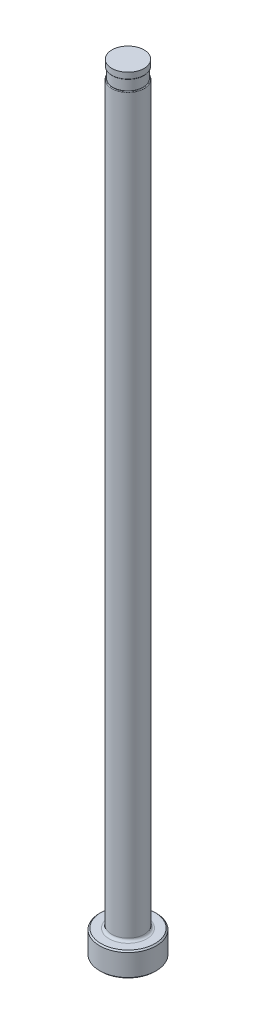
from build123d import *

# Parameters (mm, degrees)
CHAMFER1_SIZE     = 0.254
FILLET1_R         = 0.508
SKETCH2_W         = 0.2032
SKETCH2_H         = 2.032
D_SLOT_DEPTH      = 153.60197502
D_SLOT_DEPTH_BACK = 153.60197502
SKETCH5_W         = 0.01905
SKETCH5_H         = 1.27
FILLET2_R         = 0.127


with BuildPart() as part:
    # Sketch1 → Revolve1 (revolve)
    with BuildSketch(Plane.XY, mode=Mode.PRIVATE) as revolve1_sk:
        Polygon((0, 0), (-5.5499, 0), (-5.5499, 4.7498), (-3.175, 4.7498), (-3.175, 152.4), (0, 152.4), align=None)
    revolve(revolve1_sk.sketch.rotate(Axis((0, 259.958771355, 0), (0, -1, 0)), 270), axis=Axis((0, 259.958771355, 0), (0, -1, 0)))

    # Chamfer1
    chamfer1_edges = [part.edges().sort_by_distance(p)[0] for p in [
        (0, 4.7498, -5.5499),
        (0, 0, -5.5499),
    ]]
    chamfer(chamfer1_edges, length=CHAMFER1_SIZE)

    # Fillet1
    fillet1_edges = [part.edges().sort_by_distance(p)[0] for p in [
        (0, 4.7498, -3.175),
    ]]
    fillet(fillet1_edges, radius=FILLET1_R)

    # Sketch2 → Vent Relief (revolve, cut)
    with BuildSketch(Plane.XY, mode=Mode.PRIVATE) as vent_relief_sk:
        with Locations((-3.0734, 150.114)):
            Rectangle(SKETCH2_W, SKETCH2_H)
    revolve(vent_relief_sk.sketch.rotate(Axis((0, 153.448281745, 0), (0, -1, 0)), 270), axis=Axis((0, 153.448281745, 0), (0, -1, 0)), mode=Mode.SUBTRACT)

    # Sketch3 → D-Slot (cut, two sides: drawn at the far end of the back side and taken through both)
    with BuildSketch(Plane.XY.offset(-D_SLOT_DEPTH_BACK)):
        with BuildLine():
            Line((-2.9718, 150.114), (-2.9718, 86.614))
            ThreePointArc((-2.9718, 86.614), (-3.023013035, 86.046038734), (-3.175, 85.4964))
            Line((-3.175, 85.4964), (-3.175, 150.114))
            Line((-3.175, 150.114), (-2.9718, 150.114))
        make_face()
    extrude(amount=D_SLOT_DEPTH + D_SLOT_DEPTH_BACK, mode=Mode.SUBTRACT)

    # Sketch5 → Vent Diameter (revolve, cut)
    with BuildSketch(Plane.XY, mode=Mode.PRIVATE) as vent_diameter_sk:
        with Locations((-3.165475, 151.765)):
            Rectangle(SKETCH5_W, SKETCH5_H)
    revolve(vent_diameter_sk.sketch.rotate(Axis((0, 152.687735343, 0), (0, -1, 0)), 90), axis=Axis((0, 152.687735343, 0), (0, -1, 0)), mode=Mode.SUBTRACT)

    # Fillet2
    fillet2_edges = [part.edges().sort_by_distance(p)[0] for p in [
        (2.610460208, 149.098, -1.807241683),
        (0, 151.13, 3.15595),
    ]]
    fillet(fillet2_edges, radius=FILLET2_R)


solid = part.part
